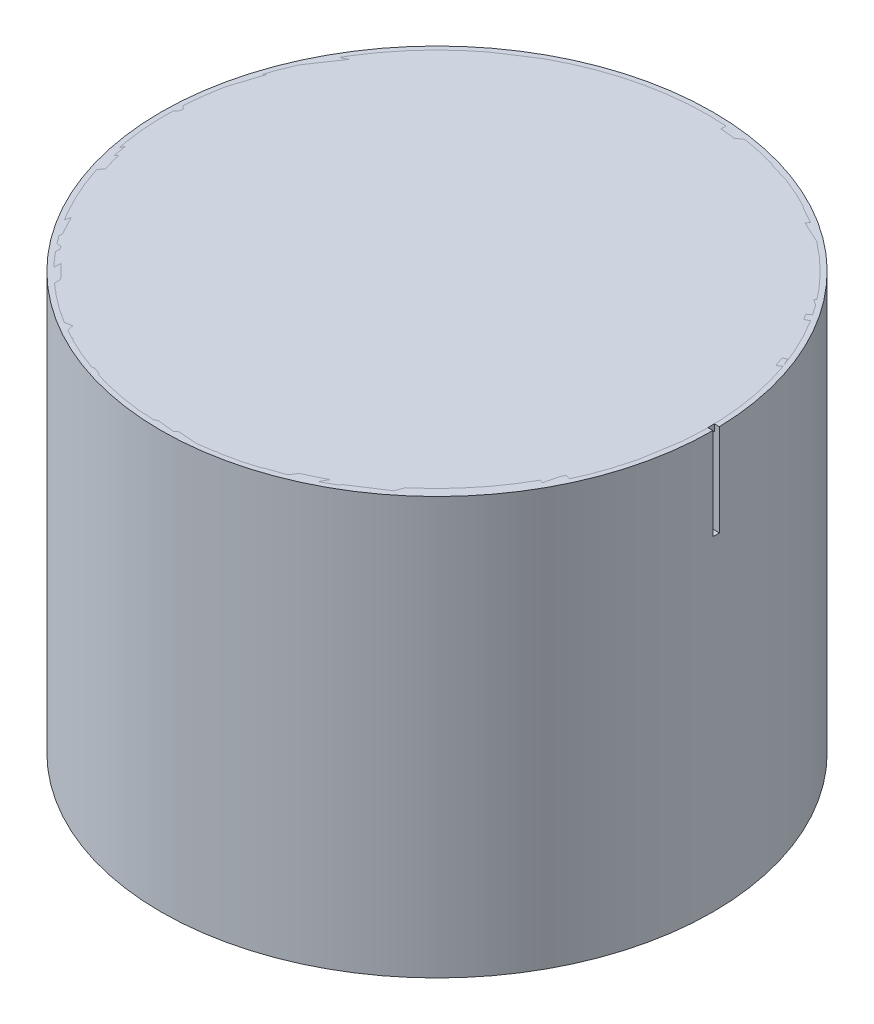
from build123d import *

# Parameters (mm, degrees)
SCHIZZO62_11_W            = 3.6
SCHIZZO62_11_H            = 112
SCHIZZO62_11_W_2          = 0.6
SCHIZZO62_11_H_2          = 0.1
SCHIZZO62_11_W_3          = 1.8
SCHIZZO62_11_H_3          = 2.4
SCHIZZO62_27_W            = 32
SCHIZZO62_27_H            = 1.2
SCHIZZO62_28_W            = 1.8
SCHIZZO62_28_H            = 2.4
SCHIZZO62_34_W            = 3.6
SCHIZZO62_34_H            = 0.1
SKETCH_54_56_95_21_32_W   = 0.6
SKETCH_54_56_95_21_32_H   = 0.1
SKETCH_54_56_95_21_32_W_2 = 3.6
TAGLIO_ESTRUSIONE1_DEPTH  = 33.7


with BuildPart() as part:
    # Schizzo62_11 → Rivoluzione17 (revolve)
    with BuildSketch(Plane.XY, mode=Mode.PRIVATE) as rivoluzione17_sk:
        Polygon((101.1, 0), (101.1, 2.4), (98.1, 2.4), (98.1, 2.3), (97.5, 2.3), (97.5, 0), align=None)
        Polygon((99.3, 38.4), (97.5, 38.4), (97.5, 25.9), (97.5, 6.5), (98.1, 7.1), (98.1, 2.4), (101.1, 2.4), (101.1, 38.4), align=None)
        with Locations((99.3, -56)):
            Rectangle(SCHIZZO62_11_W, SCHIZZO62_11_H)
        Polygon((98.1, 7.1), (97.5, 6.5), (97.5, 2.4), (98.1, 2.4), align=None)
        with Locations((97.8, 2.35)):
            Rectangle(SCHIZZO62_11_W_2, SCHIZZO62_11_H_2)
        with Locations((98.4, 39.6)):
            Rectangle(SCHIZZO62_11_W_3, SCHIZZO62_11_H_3)
        with Locations((100.2, 39.6)):
            Rectangle(SCHIZZO62_11_W_3, SCHIZZO62_11_H_3)
    revolve(rivoluzione17_sk.sketch.rotate(Axis((0, 18.4, 0), (0, 1, 0)), 90), axis=Axis((0, 18.4, 0), (0, 1, 0)))

    # Schizzo1 → Taglio-Estrusione1 (cut)
    with BuildSketch(Plane(origin=(0, 40.8, 0), x_dir=(1, 0, 0), z_dir=(0, 1, 0))):
        with BuildLine():
            Line((101.071509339, 2.4), (97.470457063, 2.4))
            ThreePointArc((97.470457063, 2.4), (97.492613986, 1.200090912), (97.5, 0))
            Line((97.5, 0), (101.1, 0))
            ThreePointArc((101.1, 0), (101.092877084, 1.200084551), (101.071509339, 2.4))
        make_face()
    extrude(amount=-TAGLIO_ESTRUSIONE1_DEPTH, mode=Mode.SUBTRACT)


with BuildPart() as body_2:
    # Schizzo62_27 → Rivoluzione26 (revolve)
    with BuildSketch(Plane.XY, mode=Mode.PRIVATE) as rivoluzione26_sk:
        with Locations((16, 39)):
            Rectangle(SCHIZZO62_27_W, SCHIZZO62_27_H)
    revolve(rivoluzione26_sk.sketch.rotate(Axis((0, 40.8, 0), (0, -1, 0)), 180), axis=Axis((0, 40.8, 0), (0, -1, 0)))


with BuildPart() as body_3:
    # Schizzo62_28 → Rivoluzione27 (revolve)
    with BuildSketch(Plane.XY, mode=Mode.PRIVATE) as rivoluzione27_sk:
        Polygon((32, 38.4), (97.5, 38.4), (97.5, 40.8), (0, 40.8), (0, 39.6), (32, 39.6), align=None)
        with Locations((98.4, 39.6)):
            Rectangle(SCHIZZO62_28_W, SCHIZZO62_28_H)
    revolve(rivoluzione27_sk.sketch.rotate(Axis((0, 18.4, 0), (0, 1, 0)), 90), axis=Axis((0, 18.4, 0), (0, 1, 0)))


with BuildPart() as body_4:
    # Schizzo62_34 → Rivoluzione29 (revolve)
    with BuildSketch(Plane.XY, mode=Mode.PRIVATE) as rivoluzione29_sk:
        Polygon((93.9, 2.3), (93.9, 2.4), (0, 2.4), (0, 0), (97.5, 0), (97.5, 2.3), align=None)
        with Locations((95.7, 2.35)):
            Rectangle(SCHIZZO62_34_W, SCHIZZO62_34_H)
    revolve(rivoluzione29_sk.sketch.rotate(Axis((0, 2.4, 0), (0, -1, 0)), 180), axis=Axis((0, 2.4, 0), (0, -1, 0)))


with BuildPart() as body_5:
    # Sketch 54_ 56_ 95 _21_ 32 → Rivoluzione28 (revolve)
    with BuildSketch(Plane.XY, mode=Mode.PRIVATE) as rivoluzione28_sk:
        Polygon((97.5, 2.4), (97.5, 6.5), (93.9, 2.9), (93.9, 2.4), align=None)
        Polygon((98.1, 7.1), (97.5, 6.5), (97.5, 2.4), (98.1, 2.4), align=None)
        with Locations((97.8, 2.35)):
            Rectangle(SKETCH_54_56_95_21_32_W, SKETCH_54_56_95_21_32_H)
        with Locations((95.7, 2.35)):
            Rectangle(SKETCH_54_56_95_21_32_W_2, SKETCH_54_56_95_21_32_H)
    revolve(rivoluzione28_sk.sketch.rotate(Axis((0, 18.4, 0), (0, 1, 0)), 90), axis=Axis((0, 18.4, 0), (0, 1, 0)))


solid = Compound([part.part, body_2.part, body_3.part, body_4.part, body_5.part])
